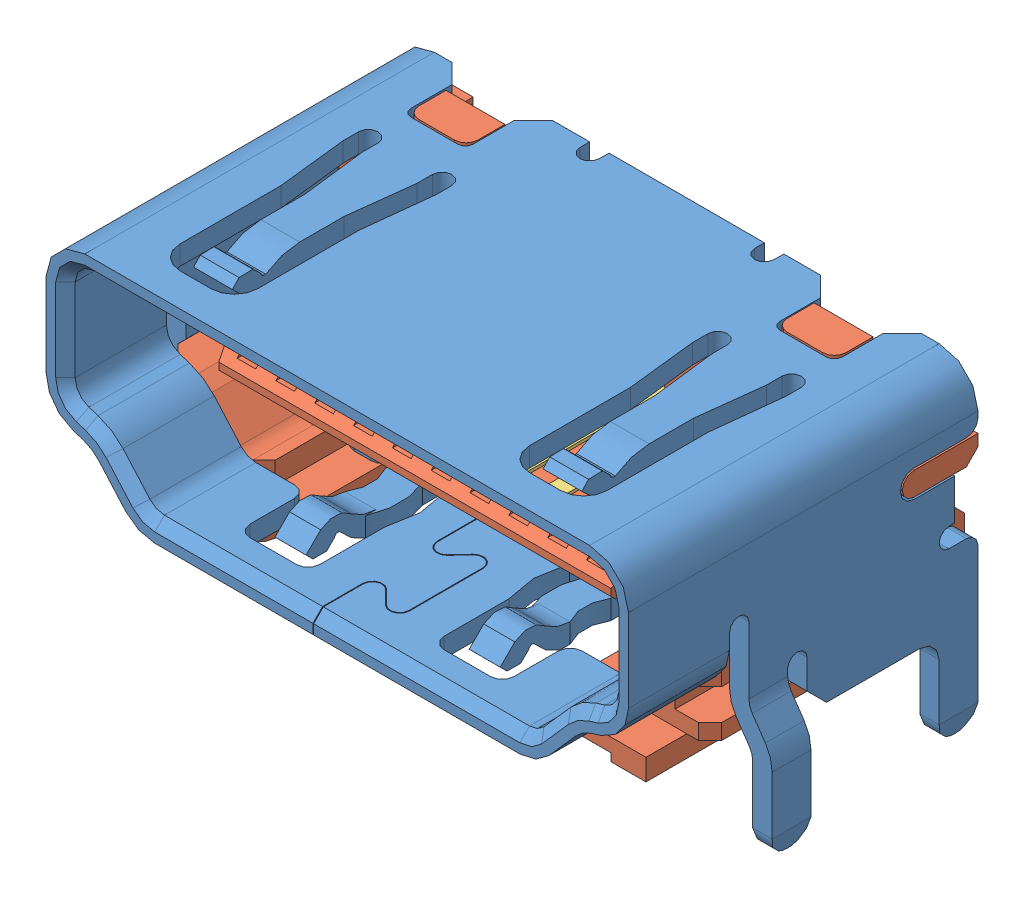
SolidWorks assembly HDMI_socket.SLDASM, configuration Default (file format 7000). Lengths in mm.
Overall size (16.2 8 9.9).
21 component instances, 4 part files, 0 mates.
Components (placement in the parent):
- HDMI_socket_cover-1: HDMI_socket_cover.SLDPRT [Default] at (-20 0 0) size (16.2 8 9)
- HDMI_socket_inside-1: HDMI_socket_inside.SLDPRT [Default] at (-20 0 0) size (15 6.1 7.6)
- HDMI_socket_large_pin-1: HDMI_socket_large_pin.SLDPRT [Valor predeterminado] at (-201.7661 0.45 76.5103) x (0 0 -1) z (0 -1 0) size (7.55 0.65 3.84)
- HDMI_socket_small_pin-1: HDMI_socket_small_pin.SLDPRT [Valor predeterminado] at (-202.2661 -0.25 76.5103) x (0 0 -1) z (0 -1 0) size (7.55 0.65 3.08)
- HDMI_socket_large_pin-2: HDMI_socket_large_pin.SLDPRT [Valor predeterminado] at (-202.7661 0.45 76.5103) x (0 0 -1) z (0 -1 0) size (7.55 0.65 3.84)
- HDMI_socket_large_pin-3: HDMI_socket_large_pin.SLDPRT [Valor predeterminado] at (-203.7661 0.45 76.5103) x (0 0 -1) z (0 -1 0) size (7.55 0.65 3.84)
- HDMI_socket_large_pin-4: HDMI_socket_large_pin.SLDPRT [Valor predeterminado] at (-204.7661 0.45 76.5103) x (0 0 -1) z (0 -1 0) size (7.55 0.65 3.84)
- HDMI_socket_large_pin-5: HDMI_socket_large_pin.SLDPRT [Valor predeterminado] at (-205.7661 0.45 76.5103) x (0 0 -1) z (0 -1 0) size (7.55 0.65 3.84)
- HDMI_socket_large_pin-6: HDMI_socket_large_pin.SLDPRT [Valor predeterminado] at (-206.7661 0.45 76.5103) x (0 0 -1) z (0 -1 0) size (7.55 0.65 3.84)
- HDMI_socket_large_pin-7: HDMI_socket_large_pin.SLDPRT [Valor predeterminado] at (-207.7661 0.45 76.5103) x (0 0 -1) z (0 -1 0) size (7.55 0.65 3.84)
- HDMI_socket_large_pin-8: HDMI_socket_large_pin.SLDPRT [Valor predeterminado] at (-208.7661 0.45 76.5103) x (0 0 -1) z (0 -1 0) size (7.55 0.65 3.84)
- HDMI_socket_large_pin-9: HDMI_socket_large_pin.SLDPRT [Valor predeterminado] at (-209.7661 0.45 76.5103) x (0 0 -1) z (0 -1 0) size (7.55 0.65 3.84)
- HDMI_socket_large_pin-10: HDMI_socket_large_pin.SLDPRT [Valor predeterminado] at (-210.7661 0.45 76.5103) x (0 0 -1) z (0 -1 0) size (7.55 0.65 3.84)
- HDMI_socket_small_pin-2: HDMI_socket_small_pin.SLDPRT [Valor predeterminado] at (-203.2661 -0.25 76.5103) x (0 0 -1) z (0 -1 0) size (7.55 0.65 3.08)
- HDMI_socket_small_pin-3: HDMI_socket_small_pin.SLDPRT [Valor predeterminado] at (-204.2661 -0.25 76.5103) x (0 0 -1) z (0 -1 0) size (7.55 0.65 3.08)
- HDMI_socket_small_pin-4: HDMI_socket_small_pin.SLDPRT [Valor predeterminado] at (-205.2661 -0.25 76.5103) x (0 0 -1) z (0 -1 0) size (7.55 0.65 3.08)
- HDMI_socket_small_pin-5: HDMI_socket_small_pin.SLDPRT [Valor predeterminado] at (-206.2661 -0.25 76.5103) x (0 0 -1) z (0 -1 0) size (7.55 0.65 3.08)
- HDMI_socket_small_pin-6: HDMI_socket_small_pin.SLDPRT [Valor predeterminado] at (-207.2661 -0.25 76.5103) x (0 0 -1) z (0 -1 0) size (7.55 0.65 3.08)
- HDMI_socket_small_pin-7: HDMI_socket_small_pin.SLDPRT [Valor predeterminado] at (-208.2661 -0.25 76.5103) x (0 0 -1) z (0 -1 0) size (7.55 0.65 3.08)
- HDMI_socket_small_pin-8: HDMI_socket_small_pin.SLDPRT [Valor predeterminado] at (-209.2661 -0.25 76.5103) x (0 0 -1) z (0 -1 0) size (7.55 0.65 3.08)
- HDMI_socket_small_pin-9: HDMI_socket_small_pin.SLDPRT [Valor predeterminado] at (-210.2661 -0.25 76.5103) x (0 0 -1) z (0 -1 0) size (7.55 0.65 3.08)
